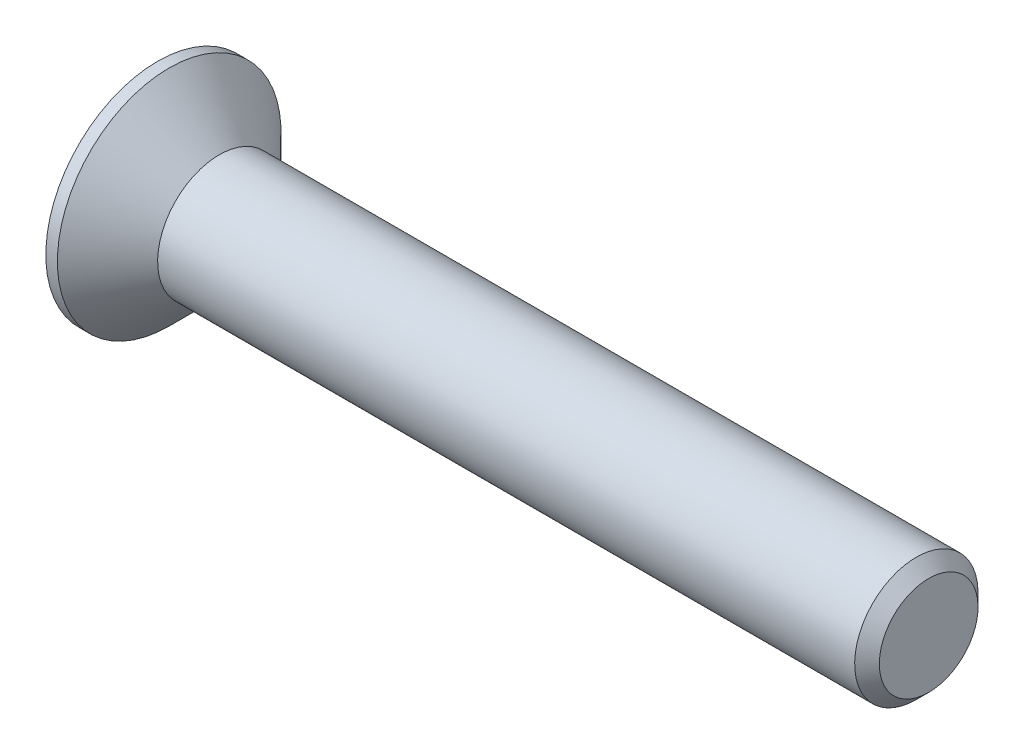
from build123d import *

# Parameters (mm, degrees)
CHAMFER1_SIZE      = 0.8
CUT_EXTRUDE1_DEPTH = 3.45


with BuildPart() as part:
    # Sketch1 → Revolve1 (revolve)
    with BuildSketch(Plane.XY, mode=Mode.PRIVATE) as revolve1_sk:
        Polygon((-4, 7.25), (-4, 0), (46, 0), (46, 4), (0, 4), (-3.25, 7.25), align=None)
    revolve(revolve1_sk.sketch.rotate(Axis((-4, 0, 0), (1, 0, 0)), 180), axis=Axis((-4, 0, 0), (1, 0, 0)))

    # Chamfer1
    chamfer1_edges = [part.edges().sort_by_distance(p)[0] for p in [
        (46, 4, 0),
    ]]
    chamfer(chamfer1_edges, length=CHAMFER1_SIZE)

    # Sketch2 → Cut-Extrude1 (cut)
    with BuildSketch(Plane.ZY.offset(4)):
        Polygon((-1.09, 4.35), (1.09, 4.35), (1.09, 1.09), (4.35, 1.09), (4.35, -1.09), (1.09, -1.09), (1.09, -4.35), (-1.09, -4.35), (-1.09, -1.09), (-4.35, -1.09), (-4.35, 1.09), (-1.09, 1.09), align=None)
    extrude(amount=-CUT_EXTRUDE1_DEPTH, mode=Mode.SUBTRACT)


solid = part.part
